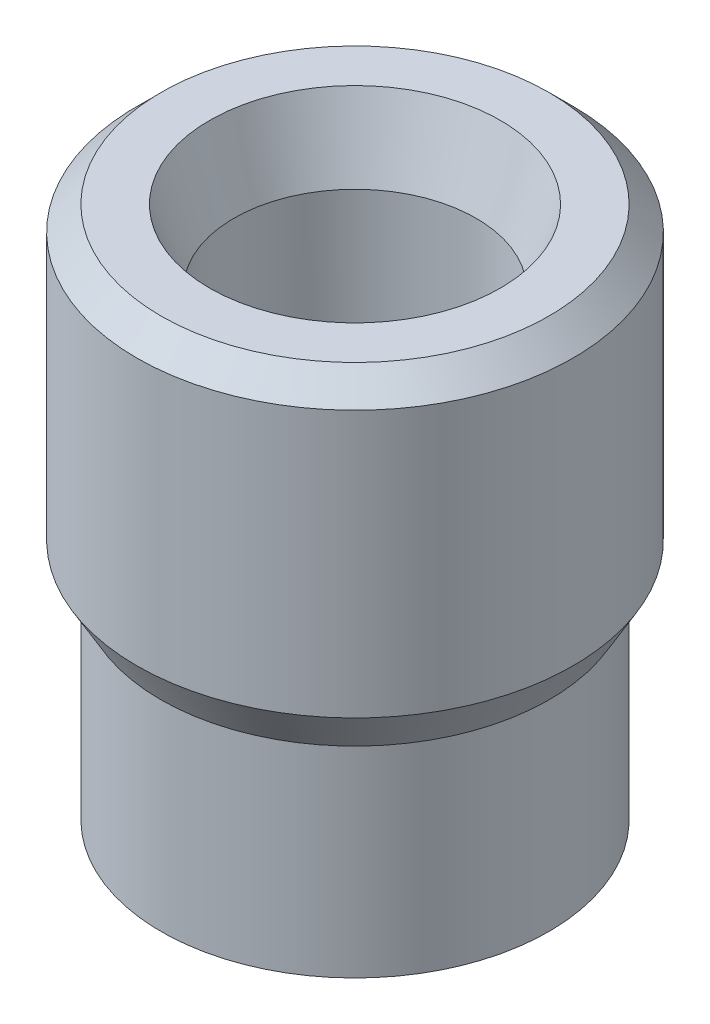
ISO-10303-21;
HEADER;
FILE_DESCRIPTION(('STEP AP214'),'2;1');
FILE_NAME('part.step','',(''),(''),'','','');
FILE_SCHEMA(('AUTOMOTIVE_DESIGN { 1 0 10303 214 1 1 1 1 }'));
ENDSEC;
DATA;
#1=APPLICATION_CONTEXT('core data for automotive mechanical design processes');
#2=APPLICATION_PROTOCOL_DEFINITION('international standard','automotive_design',2000,#1);
#3=PRODUCT_CONTEXT('',#1,'mechanical');
#4=PRODUCT('Part','Part','',(#3));
#5=PRODUCT_RELATED_PRODUCT_CATEGORY('part','',(#4));
#6=PRODUCT_DEFINITION_FORMATION('','',#4);
#7=PRODUCT_DEFINITION_CONTEXT('part definition',#1,'design');
#8=PRODUCT_DEFINITION('design','',#6,#7);
#9=PRODUCT_DEFINITION_SHAPE('','',#8);
#10=(LENGTH_UNIT() NAMED_UNIT(*) SI_UNIT(.MILLI.,.METRE.));
#11=(NAMED_UNIT(*) PLANE_ANGLE_UNIT() SI_UNIT($,.RADIAN.));
#12=(NAMED_UNIT(*) SI_UNIT($,.STERADIAN.) SOLID_ANGLE_UNIT());
#13=UNCERTAINTY_MEASURE_WITH_UNIT(LENGTH_MEASURE(1.E-05),#10,'distance_accuracy_value','');
#14=(GEOMETRIC_REPRESENTATION_CONTEXT(3) GLOBAL_UNCERTAINTY_ASSIGNED_CONTEXT((#13)) GLOBAL_UNIT_ASSIGNED_CONTEXT((#10,
#11,#12)) REPRESENTATION_CONTEXT('',''));
#15=CARTESIAN_POINT('',(0.,0.,0.));
#16=DIRECTION('',(0.,0.,1.));
#17=DIRECTION('',(1.,0.,0.));
#18=AXIS2_PLACEMENT_3D('',#15,#16,#17);
#19=CARTESIAN_POINT('',(0.,8.3,0.));
#20=DIRECTION('',(0.,-1.,0.));
#21=DIRECTION('',(0.,0.,-1.));
#22=AXIS2_PLACEMENT_3D('',#19,#20,#21);
#23=CYLINDRICAL_SURFACE('',#22,8.);
#24=CARTESIAN_POINT('',(0.,8.3,0.));
#25=DIRECTION('',(0.,1.,0.));
#26=DIRECTION('',(0.,0.,1.));
#27=AXIS2_PLACEMENT_3D('',#24,#25,#26);
#28=CIRCLE('',#27,8.);
#29=CARTESIAN_POINT('',(0.,8.3,-8.));
#30=VERTEX_POINT('',#29);
#31=EDGE_CURVE('E59',#30,#30,#28,.T.);
#32=CARTESIAN_POINT('',(0.,0.,0.));
#33=DIRECTION('',(0.,1.,0.));
#34=DIRECTION('',(0.,0.,1.));
#35=AXIS2_PLACEMENT_3D('',#32,#33,#34);
#36=CIRCLE('',#35,8.);
#37=CARTESIAN_POINT('',(0.,0.,-8.));
#38=VERTEX_POINT('',#37);
#39=EDGE_CURVE('E60',#38,#38,#36,.T.);
#40=CARTESIAN_POINT('',(0.,8.3,-8.));
#41=CARTESIAN_POINT('',(0.,8.21354166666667,-8.));
#42=CARTESIAN_POINT('',(0.,8.12708333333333,-8.));
#43=CARTESIAN_POINT('',(0.,7.95416666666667,-8.));
#44=CARTESIAN_POINT('',(0.,7.86770833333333,-8.));
#45=CARTESIAN_POINT('',(0.,7.69479166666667,-8.));
#46=CARTESIAN_POINT('',(0.,7.60833333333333,-8.));
#47=CARTESIAN_POINT('',(0.,7.43541666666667,-8.));
#48=CARTESIAN_POINT('',(0.,7.34895833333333,-8.));
#49=CARTESIAN_POINT('',(0.,7.17604166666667,-8.));
#50=CARTESIAN_POINT('',(0.,7.08958333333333,-8.));
#51=CARTESIAN_POINT('',(0.,6.91666666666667,-8.));
#52=CARTESIAN_POINT('',(0.,6.83020833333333,-8.));
#53=CARTESIAN_POINT('',(0.,6.65729166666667,-8.));
#54=CARTESIAN_POINT('',(0.,6.57083333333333,-8.));
#55=CARTESIAN_POINT('',(0.,6.39791666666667,-8.));
#56=CARTESIAN_POINT('',(0.,6.31145833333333,-8.));
#57=CARTESIAN_POINT('',(0.,6.13854166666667,-8.));
#58=CARTESIAN_POINT('',(0.,6.05208333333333,-8.));
#59=CARTESIAN_POINT('',(0.,5.87916666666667,-8.));
#60=CARTESIAN_POINT('',(0.,5.79270833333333,-8.));
#61=CARTESIAN_POINT('',(0.,5.61979166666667,-8.));
#62=CARTESIAN_POINT('',(0.,5.53333333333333,-8.));
#63=CARTESIAN_POINT('',(0.,5.36041666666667,-8.));
#64=CARTESIAN_POINT('',(0.,5.27395833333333,-8.));
#65=CARTESIAN_POINT('',(0.,5.10104166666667,-8.));
#66=CARTESIAN_POINT('',(0.,5.01458333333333,-8.));
#67=CARTESIAN_POINT('',(0.,4.84166666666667,-8.));
#68=CARTESIAN_POINT('',(0.,4.75520833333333,-8.));
#69=CARTESIAN_POINT('',(0.,4.58229166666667,-8.));
#70=CARTESIAN_POINT('',(0.,4.49583333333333,-8.));
#71=CARTESIAN_POINT('',(0.,4.32291666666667,-8.));
#72=CARTESIAN_POINT('',(0.,4.23645833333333,-8.));
#73=CARTESIAN_POINT('',(0.,4.06354166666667,-8.));
#74=CARTESIAN_POINT('',(0.,3.97708333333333,-8.));
#75=CARTESIAN_POINT('',(0.,3.80416666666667,-8.));
#76=CARTESIAN_POINT('',(0.,3.71770833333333,-8.));
#77=CARTESIAN_POINT('',(0.,3.54479166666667,-8.));
#78=CARTESIAN_POINT('',(0.,3.45833333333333,-8.));
#79=CARTESIAN_POINT('',(0.,3.28541666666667,-8.));
#80=CARTESIAN_POINT('',(0.,3.19895833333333,-8.));
#81=CARTESIAN_POINT('',(0.,3.02604166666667,-8.));
#82=CARTESIAN_POINT('',(0.,2.93958333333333,-8.));
#83=CARTESIAN_POINT('',(0.,2.76666666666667,-8.));
#84=CARTESIAN_POINT('',(0.,2.68020833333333,-8.));
#85=CARTESIAN_POINT('',(0.,2.50729166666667,-8.));
#86=CARTESIAN_POINT('',(0.,2.42083333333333,-8.));
#87=CARTESIAN_POINT('',(0.,2.24791666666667,-8.));
#88=CARTESIAN_POINT('',(0.,2.16145833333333,-8.));
#89=CARTESIAN_POINT('',(0.,1.98854166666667,-8.));
#90=CARTESIAN_POINT('',(0.,1.90208333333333,-8.));
#91=CARTESIAN_POINT('',(0.,1.72916666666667,-8.));
#92=CARTESIAN_POINT('',(0.,1.64270833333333,-8.));
#93=CARTESIAN_POINT('',(0.,1.46979166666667,-8.));
#94=CARTESIAN_POINT('',(0.,1.38333333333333,-8.));
#95=CARTESIAN_POINT('',(0.,1.21041666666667,-8.));
#96=CARTESIAN_POINT('',(0.,1.12395833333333,-8.));
#97=CARTESIAN_POINT('',(0.,0.951041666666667,-8.));
#98=CARTESIAN_POINT('',(0.,0.864583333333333,-8.));
#99=CARTESIAN_POINT('',(0.,0.691666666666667,-8.));
#100=CARTESIAN_POINT('',(0.,0.605208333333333,-8.));
#101=CARTESIAN_POINT('',(0.,0.432291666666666,-8.));
#102=CARTESIAN_POINT('',(0.,0.345833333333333,-8.));
#103=CARTESIAN_POINT('',(0.,0.172916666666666,-8.));
#104=CARTESIAN_POINT('',(0.,0.086458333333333,-8.));
#105=CARTESIAN_POINT('',(0.,0.,-8.));
#106=B_SPLINE_CURVE_WITH_KNOTS('',3,(#40,#41,#42,#43,#44,#45,#46,#47,#48,#49,#50,#51,#52,#53,
#54,#55,#56,#57,#58,#59,#60,#61,#62,#63,#64,#65,#66,#67,#68,#69,#70,#71,#72,#73,#74,#75,#76,#77,
#78,#79,#80,#81,#82,#83,#84,#85,#86,#87,#88,#89,#90,#91,#92,#93,#94,#95,#96,#97,#98,#99,#100,
#101,#102,#103,#104,#105),.UNSPECIFIED.,.F.,.F.,(4,2,2,2,2,2,2,2,2,2,2,2,2,2,2,2,2,2,2,2,2,2,2,
2,2,2,2,2,2,2,2,2,4),(0.,0.259374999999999,0.518749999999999,0.778124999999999,1.0375,1.296875,
1.55625,1.815625,2.075,2.334375,2.59375,2.853125,3.1125,3.371875,3.63125,3.890625,4.15,4.409375,
4.66875,4.928125,5.1875,5.446875,5.70625,5.965625,6.225,6.484375,6.74375,7.003125,7.2625,
7.521875,7.78125,8.040625,8.3),.UNSPECIFIED.);
#107=EDGE_CURVE('BSEAM33',#30,#38,#106,.T.);
#108=ORIENTED_EDGE('',*,*,#31,.F.);
#109=ORIENTED_EDGE('',*,*,#39,.T.);
#110=ORIENTED_EDGE('',*,*,#107,.T.);
#111=ORIENTED_EDGE('',*,*,#107,.F.);
#112=EDGE_LOOP('',(#108,#110,#109,#111));
#113=FACE_BOUND('',#112,.T.);
#114=ADVANCED_FACE('F33',(#113),#23,.T.);
#115=CARTESIAN_POINT('',(0.,0.,0.));
#116=DIRECTION('',(0.,1.,0.));
#117=DIRECTION('',(0.,0.,1.));
#118=AXIS2_PLACEMENT_3D('',#115,#116,#117);
#119=PLANE('',#118);
#120=CARTESIAN_POINT('',(0.,0.,0.));
#121=DIRECTION('',(0.,-1.,0.));
#122=DIRECTION('',(0.,0.,-1.));
#123=AXIS2_PLACEMENT_3D('',#120,#121,#122);
#124=CIRCLE('',#123,3.);
#125=CARTESIAN_POINT('',(0.,0.,-3.));
#126=VERTEX_POINT('',#125);
#127=EDGE_CURVE('E63',#126,#126,#124,.T.);
#128=ORIENTED_EDGE('',*,*,#127,.F.);
#129=EDGE_LOOP('',(#128));
#130=FACE_BOUND('',#129,.T.);
#131=ORIENTED_EDGE('',*,*,#39,.F.);
#132=EDGE_LOOP('',(#131));
#133=FACE_BOUND('',#132,.T.);
#134=ADVANCED_FACE('F89',(#130,#133),#119,.F.);
#135=CARTESIAN_POINT('',(0.,8.3,0.));
#136=DIRECTION('',(0.,1.,0.));
#137=DIRECTION('',(0.,0.,1.));
#138=AXIS2_PLACEMENT_3D('',#135,#136,#137);
#139=PLANE('',#138);
#140=CARTESIAN_POINT('',(0.,8.3,0.));
#141=DIRECTION('',(0.,1.,0.));
#142=DIRECTION('',(0.,0.,1.));
#143=AXIS2_PLACEMENT_3D('',#140,#141,#142);
#144=CIRCLE('',#143,8.01850454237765);
#145=CARTESIAN_POINT('',(0.,8.3,8.01850454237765));
#146=VERTEX_POINT('',#145);
#147=EDGE_CURVE('E53',#146,#146,#144,.F.);
#148=ORIENTED_EDGE('',*,*,#147,.T.);
#149=EDGE_LOOP('',(#148));
#150=FACE_BOUND('',#149,.T.);
#151=ORIENTED_EDGE('',*,*,#31,.T.);
#152=EDGE_LOOP('',(#151));
#153=FACE_BOUND('',#152,.T.);
#154=ADVANCED_FACE('F95',(#150,#153),#139,.F.);
#155=CARTESIAN_POINT('',(0.,22.,0.));
#156=DIRECTION('',(0.,-1.,0.));
#157=DIRECTION('',(0.,0.,-1.));
#158=AXIS2_PLACEMENT_3D('',#155,#156,#157);
#159=CYLINDRICAL_SURFACE('',#158,9.);
#160=CARTESIAN_POINT('',(0.,21.,0.));
#161=DIRECTION('',(0.,1.,0.));
#162=DIRECTION('',(0.,0.,1.));
#163=AXIS2_PLACEMENT_3D('',#160,#161,#162);
#164=CIRCLE('',#163,9.);
#165=CARTESIAN_POINT('',(0.,21.,-9.));
#166=VERTEX_POINT('',#165);
#167=EDGE_CURVE('E44',#166,#166,#164,.F.);
#168=CARTESIAN_POINT('',(0.,9.99999999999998,0.));
#169=DIRECTION('',(0.,1.,0.));
#170=DIRECTION('',(0.,0.,1.));
#171=AXIS2_PLACEMENT_3D('',#168,#169,#170);
#172=CIRCLE('',#171,9.);
#173=CARTESIAN_POINT('',(0.,9.99999999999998,-9.));
#174=VERTEX_POINT('',#173);
#175=EDGE_CURVE('E56',#174,#174,#172,.T.);
#176=CARTESIAN_POINT('',(0.,21.,-9.));
#177=CARTESIAN_POINT('',(0.,20.8854166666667,-9.));
#178=CARTESIAN_POINT('',(0.,20.7708333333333,-9.));
#179=CARTESIAN_POINT('',(0.,20.5416666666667,-9.));
#180=CARTESIAN_POINT('',(0.,20.4270833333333,-9.));
#181=CARTESIAN_POINT('',(0.,20.1979166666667,-9.));
#182=CARTESIAN_POINT('',(0.,20.0833333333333,-9.));
#183=CARTESIAN_POINT('',(0.,19.8541666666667,-9.));
#184=CARTESIAN_POINT('',(0.,19.7395833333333,-9.));
#185=CARTESIAN_POINT('',(0.,19.5104166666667,-9.));
#186=CARTESIAN_POINT('',(0.,19.3958333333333,-9.));
#187=CARTESIAN_POINT('',(0.,19.1666666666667,-9.));
#188=CARTESIAN_POINT('',(0.,19.0520833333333,-9.));
#189=CARTESIAN_POINT('',(0.,18.8229166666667,-9.));
#190=CARTESIAN_POINT('',(0.,18.7083333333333,-9.));
#191=CARTESIAN_POINT('',(0.,18.4791666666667,-9.));
#192=CARTESIAN_POINT('',(0.,18.3645833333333,-9.));
#193=CARTESIAN_POINT('',(0.,18.1354166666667,-9.));
#194=CARTESIAN_POINT('',(0.,18.0208333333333,-9.));
#195=CARTESIAN_POINT('',(0.,17.7916666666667,-9.));
#196=CARTESIAN_POINT('',(0.,17.6770833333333,-9.));
#197=CARTESIAN_POINT('',(0.,17.4479166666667,-9.));
#198=CARTESIAN_POINT('',(0.,17.3333333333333,-9.));
#199=CARTESIAN_POINT('',(0.,17.1041666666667,-9.));
#200=CARTESIAN_POINT('',(0.,16.9895833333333,-9.));
#201=CARTESIAN_POINT('',(0.,16.7604166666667,-9.));
#202=CARTESIAN_POINT('',(0.,16.6458333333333,-9.));
#203=CARTESIAN_POINT('',(0.,16.4166666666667,-9.));
#204=CARTESIAN_POINT('',(0.,16.3020833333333,-9.));
#205=CARTESIAN_POINT('',(0.,16.0729166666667,-9.));
#206=CARTESIAN_POINT('',(0.,15.9583333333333,-9.));
#207=CARTESIAN_POINT('',(0.,15.7291666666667,-9.));
#208=CARTESIAN_POINT('',(0.,15.6145833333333,-9.));
#209=CARTESIAN_POINT('',(0.,15.3854166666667,-9.));
#210=CARTESIAN_POINT('',(0.,15.2708333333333,-9.));
#211=CARTESIAN_POINT('',(0.,15.0416666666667,-9.));
#212=CARTESIAN_POINT('',(0.,14.9270833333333,-9.));
#213=CARTESIAN_POINT('',(0.,14.6979166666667,-9.));
#214=CARTESIAN_POINT('',(0.,14.5833333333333,-9.));
#215=CARTESIAN_POINT('',(0.,14.3541666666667,-9.));
#216=CARTESIAN_POINT('',(0.,14.2395833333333,-9.));
#217=CARTESIAN_POINT('',(0.,14.0104166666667,-9.));
#218=CARTESIAN_POINT('',(0.,13.8958333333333,-9.));
#219=CARTESIAN_POINT('',(0.,13.6666666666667,-9.));
#220=CARTESIAN_POINT('',(0.,13.5520833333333,-9.));
#221=CARTESIAN_POINT('',(0.,13.3229166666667,-9.));
#222=CARTESIAN_POINT('',(0.,13.2083333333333,-9.));
#223=CARTESIAN_POINT('',(0.,12.9791666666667,-9.));
#224=CARTESIAN_POINT('',(0.,12.8645833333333,-9.));
#225=CARTESIAN_POINT('',(0.,12.6354166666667,-9.));
#226=CARTESIAN_POINT('',(0.,12.5208333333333,-9.));
#227=CARTESIAN_POINT('',(0.,12.2916666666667,-9.));
#228=CARTESIAN_POINT('',(0.,12.1770833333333,-9.));
#229=CARTESIAN_POINT('',(0.,11.9479166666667,-9.));
#230=CARTESIAN_POINT('',(0.,11.8333333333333,-9.));
#231=CARTESIAN_POINT('',(0.,11.6041666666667,-9.));
#232=CARTESIAN_POINT('',(0.,11.4895833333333,-9.));
#233=CARTESIAN_POINT('',(0.,11.2604166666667,-9.));
#234=CARTESIAN_POINT('',(0.,11.1458333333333,-9.));
#235=CARTESIAN_POINT('',(0.,10.9166666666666,-9.));
#236=CARTESIAN_POINT('',(0.,10.8020833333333,-9.));
#237=CARTESIAN_POINT('',(0.,10.5729166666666,-9.));
#238=CARTESIAN_POINT('',(0.,10.4583333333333,-9.));
#239=CARTESIAN_POINT('',(0.,10.2291666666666,-9.));
#240=CARTESIAN_POINT('',(0.,10.1145833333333,-9.));
#241=CARTESIAN_POINT('',(0.,9.99999999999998,-9.));
#242=B_SPLINE_CURVE_WITH_KNOTS('',3,(#176,#177,#178,#179,#180,#181,#182,#183,#184,#185,#186,
#187,#188,#189,#190,#191,#192,#193,#194,#195,#196,#197,#198,#199,#200,#201,#202,#203,#204,#205,
#206,#207,#208,#209,#210,#211,#212,#213,#214,#215,#216,#217,#218,#219,#220,#221,#222,#223,#224,
#225,#226,#227,#228,#229,#230,#231,#232,#233,#234,#235,#236,#237,#238,#239,#240,#241),
.UNSPECIFIED.,.F.,.F.,(4,2,2,2,2,2,2,2,2,2,2,2,2,2,2,2,2,2,2,2,2,2,2,2,2,2,2,2,2,2,2,2,4),(0.,
0.34375,0.687500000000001,1.03125,1.375,1.71875,2.06250000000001,2.40625000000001,
2.75000000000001,3.09375000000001,3.43750000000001,3.78125000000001,4.12500000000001,
4.46875000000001,4.81250000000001,5.15625000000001,5.50000000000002,5.84375000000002,
6.18750000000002,6.53125000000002,6.87500000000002,7.21875000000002,7.56250000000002,
7.90625000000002,8.25000000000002,8.59375000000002,8.93750000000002,9.28125000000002,
9.62500000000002,9.96875000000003,10.3125,10.65625,11.),.UNSPECIFIED.);
#243=EDGE_CURVE('BSEAM119',#166,#174,#242,.T.);
#244=ORIENTED_EDGE('',*,*,#167,.T.);
#245=ORIENTED_EDGE('',*,*,#175,.T.);
#246=ORIENTED_EDGE('',*,*,#243,.T.);
#247=ORIENTED_EDGE('',*,*,#243,.F.);
#248=EDGE_LOOP('',(#244,#246,#245,#247));
#249=FACE_BOUND('',#248,.T.);
#250=ADVANCED_FACE('F119',(#249),#159,.T.);
#251=CARTESIAN_POINT('',(0.,22.,0.));
#252=DIRECTION('',(0.,1.,0.));
#253=DIRECTION('',(0.,0.,1.));
#254=AXIS2_PLACEMENT_3D('',#251,#252,#253);
#255=PLANE('',#254);
#256=CARTESIAN_POINT('',(0.,22.,0.));
#257=DIRECTION('',(0.,1.,0.));
#258=DIRECTION('',(0.,0.,1.));
#259=AXIS2_PLACEMENT_3D('',#256,#257,#258);
#260=CIRCLE('',#259,6.00000000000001);
#261=CARTESIAN_POINT('',(0.,22.,6.00000000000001));
#262=VERTEX_POINT('',#261);
#263=EDGE_CURVE('E10',#262,#262,#260,.F.);
#264=ORIENTED_EDGE('',*,*,#263,.T.);
#265=EDGE_LOOP('',(#264));
#266=FACE_BOUND('',#265,.T.);
#267=CARTESIAN_POINT('',(0.,22.,0.));
#268=DIRECTION('',(0.,1.,0.));
#269=DIRECTION('',(0.,0.,1.));
#270=AXIS2_PLACEMENT_3D('',#267,#268,#269);
#271=CIRCLE('',#270,8.00000000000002);
#272=CARTESIAN_POINT('',(0.,22.,8.00000000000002));
#273=VERTEX_POINT('',#272);
#274=EDGE_CURVE('E48',#273,#273,#271,.T.);
#275=ORIENTED_EDGE('',*,*,#274,.T.);
#276=EDGE_LOOP('',(#275));
#277=FACE_BOUND('',#276,.T.);
#278=ADVANCED_FACE('F105',(#266,#277),#255,.T.);
#279=CARTESIAN_POINT('',(0.,9.99999999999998,0.));
#280=DIRECTION('',(0.,1.,0.));
#281=DIRECTION('',(0.,0.,1.));
#282=AXIS2_PLACEMENT_3D('',#279,#280,#281);
#283=CONICAL_SURFACE('',#282,9.,0.523598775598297);
#284=ORIENTED_EDGE('',*,*,#147,.F.);
#285=EDGE_LOOP('',(#284));
#286=FACE_BOUND('',#285,.T.);
#287=ORIENTED_EDGE('',*,*,#175,.F.);
#288=EDGE_LOOP('',(#287));
#289=FACE_BOUND('',#288,.T.);
#290=ADVANCED_FACE('F102',(#286,#289),#283,.T.);
#291=CARTESIAN_POINT('',(0.,22.,0.));
#292=DIRECTION('',(0.,-1.,0.));
#293=DIRECTION('',(0.,0.,-1.));
#294=AXIS2_PLACEMENT_3D('',#291,#292,#293);
#295=CONICAL_SURFACE('',#294,8.00000000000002,0.785398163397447);
#296=ORIENTED_EDGE('',*,*,#167,.F.);
#297=EDGE_LOOP('',(#296));
#298=FACE_BOUND('',#297,.T.);
#299=ORIENTED_EDGE('',*,*,#274,.F.);
#300=EDGE_LOOP('',(#299));
#301=FACE_BOUND('',#300,.T.);
#302=ADVANCED_FACE('F104',(#298,#301),#295,.T.);
#303=CARTESIAN_POINT('',(0.,11.,0.));
#304=DIRECTION('',(0.,-1.,0.));
#305=DIRECTION('',(0.,0.,-1.));
#306=AXIS2_PLACEMENT_3D('',#303,#304,#305);
#307=CYLINDRICAL_SURFACE('',#306,3.);
#308=CARTESIAN_POINT('',(0.,11.,0.));
#309=DIRECTION('',(0.,-1.,0.));
#310=DIRECTION('',(0.,0.,-1.));
#311=AXIS2_PLACEMENT_3D('',#308,#309,#310);
#312=CIRCLE('',#311,3.);
#313=CARTESIAN_POINT('',(0.,11.,-3.));
#314=VERTEX_POINT('',#313);
#315=EDGE_CURVE('E68',#314,#314,#312,.F.);
#316=ORIENTED_EDGE('',*,*,#315,.T.);
#317=EDGE_LOOP('',(#316));
#318=FACE_BOUND('',#317,.T.);
#319=ORIENTED_EDGE('',*,*,#127,.T.);
#320=EDGE_LOOP('',(#319));
#321=FACE_BOUND('',#320,.T.);
#322=ADVANCED_FACE('F86',(#318,#321),#307,.F.);
#323=CARTESIAN_POINT('',(0.,11.,0.));
#324=DIRECTION('',(0.,-1.,0.));
#325=DIRECTION('',(0.,0.,-1.));
#326=AXIS2_PLACEMENT_3D('',#323,#324,#325);
#327=PLANE('',#326);
#328=CARTESIAN_POINT('',(0.,11.,0.));
#329=DIRECTION('',(0.,-1.,0.));
#330=DIRECTION('',(0.,0.,-1.));
#331=AXIS2_PLACEMENT_3D('',#328,#329,#330);
#332=CIRCLE('',#331,5.);
#333=CARTESIAN_POINT('',(0.,11.,-5.));
#334=VERTEX_POINT('',#333);
#335=EDGE_CURVE('E71',#334,#334,#332,.F.);
#336=ORIENTED_EDGE('',*,*,#335,.T.);
#337=EDGE_LOOP('',(#336));
#338=FACE_BOUND('',#337,.T.);
#339=ORIENTED_EDGE('',*,*,#315,.F.);
#340=EDGE_LOOP('',(#339));
#341=FACE_BOUND('',#340,.T.);
#342=ADVANCED_FACE('F75',(#338,#341),#327,.F.);
#343=CARTESIAN_POINT('',(0.,-3.14213562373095,0.));
#344=DIRECTION('',(0.,1.,0.));
#345=DIRECTION('',(0.,0.,1.));
#346=AXIS2_PLACEMENT_3D('',#343,#344,#345);
#347=CYLINDRICAL_SURFACE('',#346,5.);
#348=CARTESIAN_POINT('',(0.,18.9999999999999,0.));
#349=DIRECTION('',(0.,1.,0.));
#350=DIRECTION('',(0.,0.,1.));
#351=AXIS2_PLACEMENT_3D('',#348,#349,#350);
#352=CIRCLE('',#351,5.);
#353=CARTESIAN_POINT('',(0.,18.9999999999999,5.));
#354=VERTEX_POINT('',#353);
#355=EDGE_CURVE('E40',#354,#354,#352,.T.);
#356=ORIENTED_EDGE('',*,*,#355,.T.);
#357=EDGE_LOOP('',(#356));
#358=FACE_BOUND('',#357,.T.);
#359=ORIENTED_EDGE('',*,*,#335,.F.);
#360=EDGE_LOOP('',(#359));
#361=FACE_BOUND('',#360,.T.);
#362=ADVANCED_FACE('F78',(#358,#361),#347,.F.);
#363=CARTESIAN_POINT('',(0.,18.9999999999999,0.));
#364=DIRECTION('',(0.,1.,0.));
#365=DIRECTION('',(0.,0.,1.));
#366=AXIS2_PLACEMENT_3D('',#363,#364,#365);
#367=CONICAL_SURFACE('',#366,5.,0.32175055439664);
#368=ORIENTED_EDGE('',*,*,#263,.F.);
#369=EDGE_LOOP('',(#368));
#370=FACE_BOUND('',#369,.T.);
#371=ORIENTED_EDGE('',*,*,#355,.F.);
#372=EDGE_LOOP('',(#371));
#373=FACE_BOUND('',#372,.T.);
#374=ADVANCED_FACE('F35',(#370,#373),#367,.F.);
#375=CLOSED_SHELL('',(#114,#134,#154,#250,#278,#290,#302,#322,#342,#362,#374));
#376=MANIFOLD_SOLID_BREP('B2',#375);
#377=ADVANCED_BREP_SHAPE_REPRESENTATION('',(#18,#376),#14);
#378=SHAPE_DEFINITION_REPRESENTATION(#9,#377);
ENDSEC;
END-ISO-10303-21;
